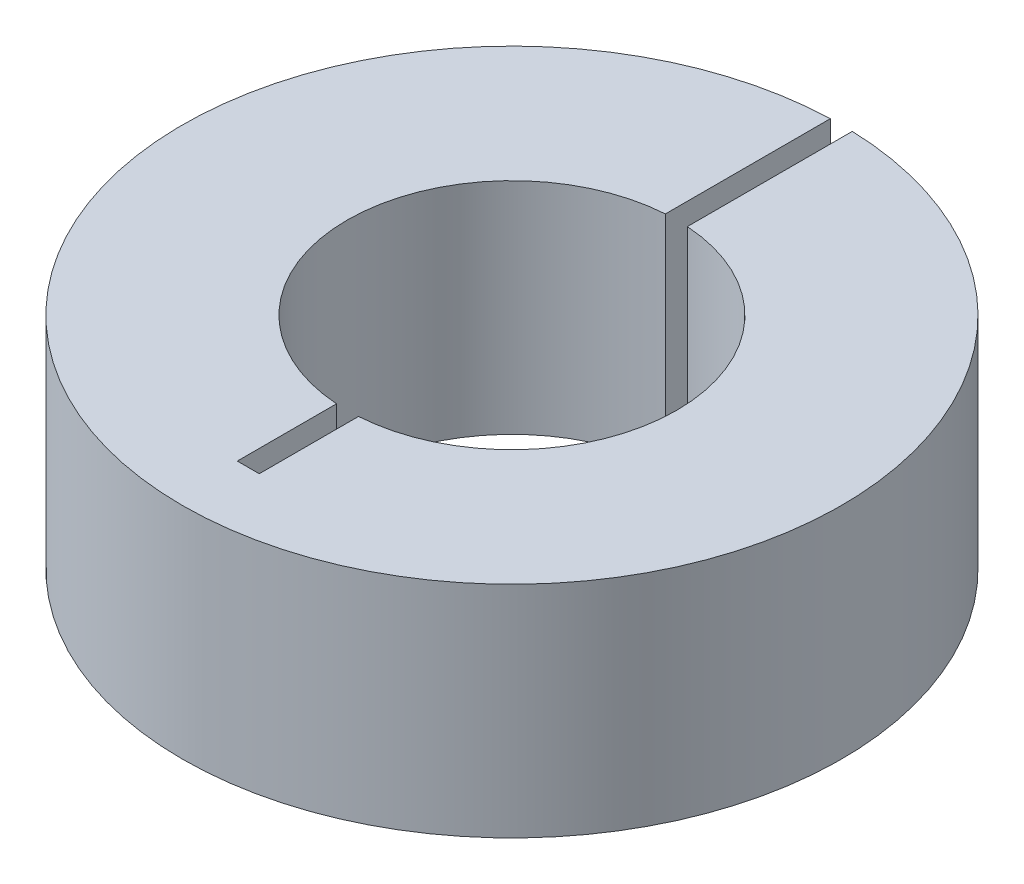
ISO-10303-21;
HEADER;
FILE_DESCRIPTION(('STEP AP214'),'2;1');
FILE_NAME('part.step','',(''),(''),'','','');
FILE_SCHEMA(('AUTOMOTIVE_DESIGN { 1 0 10303 214 1 1 1 1 }'));
ENDSEC;
DATA;
#1=APPLICATION_CONTEXT('core data for automotive mechanical design processes');
#2=APPLICATION_PROTOCOL_DEFINITION('international standard','automotive_design',2000,#1);
#3=PRODUCT_CONTEXT('',#1,'mechanical');
#4=PRODUCT('Part','Part','',(#3));
#5=PRODUCT_RELATED_PRODUCT_CATEGORY('part','',(#4));
#6=PRODUCT_DEFINITION_FORMATION('','',#4);
#7=PRODUCT_DEFINITION_CONTEXT('part definition',#1,'design');
#8=PRODUCT_DEFINITION('design','',#6,#7);
#9=PRODUCT_DEFINITION_SHAPE('','',#8);
#10=(LENGTH_UNIT() NAMED_UNIT(*) SI_UNIT(.MILLI.,.METRE.));
#11=(NAMED_UNIT(*) PLANE_ANGLE_UNIT() SI_UNIT($,.RADIAN.));
#12=(NAMED_UNIT(*) SI_UNIT($,.STERADIAN.) SOLID_ANGLE_UNIT());
#13=UNCERTAINTY_MEASURE_WITH_UNIT(LENGTH_MEASURE(1.E-05),#10,'distance_accuracy_value','');
#14=(GEOMETRIC_REPRESENTATION_CONTEXT(3) GLOBAL_UNCERTAINTY_ASSIGNED_CONTEXT((#13)) GLOBAL_UNIT_ASSIGNED_CONTEXT((#10,
#11,#12)) REPRESENTATION_CONTEXT('',''));
#15=CARTESIAN_POINT('',(0.,0.,0.));
#16=DIRECTION('',(0.,0.,1.));
#17=DIRECTION('',(1.,0.,0.));
#18=AXIS2_PLACEMENT_3D('',#15,#16,#17);
#19=CARTESIAN_POINT('',(0.,12.7,0.));
#20=DIRECTION('',(0.,-1.,0.));
#21=DIRECTION('',(0.,0.,-1.));
#22=AXIS2_PLACEMENT_3D('',#19,#20,#21);
#23=CYLINDRICAL_SURFACE('',#22,9.525);
#24=DIRECTION('',(0.,-1.,0.));
#25=VECTOR('',#24,1.);
#26=CARTESIAN_POINT('',(-0.635,12.7,-9.50380976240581));
#27=LINE('',#26,#25);
#28=CARTESIAN_POINT('',(-0.635,12.7,-9.50380976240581));
#29=VERTEX_POINT('',#28);
#30=CARTESIAN_POINT('',(-0.635,0.,-9.50380976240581));
#31=VERTEX_POINT('',#30);
#32=EDGE_CURVE('E11',#29,#31,#27,.T.);
#33=ORIENTED_EDGE('',*,*,#32,.F.);
#34=CARTESIAN_POINT('',(0.,12.7,0.));
#35=DIRECTION('',(0.,1.,0.));
#36=DIRECTION('',(0.,0.,1.));
#37=AXIS2_PLACEMENT_3D('',#34,#35,#36);
#38=CIRCLE('',#37,9.525);
#39=CARTESIAN_POINT('',(-0.635,12.7,9.50380976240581));
#40=VERTEX_POINT('',#39);
#41=EDGE_CURVE('E139',#29,#40,#38,.T.);
#42=ORIENTED_EDGE('',*,*,#41,.T.);
#43=DIRECTION('',(0.,-1.,0.));
#44=VECTOR('',#43,1.);
#45=CARTESIAN_POINT('',(-0.635,12.7,9.50380976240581));
#46=LINE('',#45,#44);
#47=CARTESIAN_POINT('',(-0.635,0.,9.50380976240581));
#48=VERTEX_POINT('',#47);
#49=EDGE_CURVE('E38',#48,#40,#46,.F.);
#50=ORIENTED_EDGE('',*,*,#49,.F.);
#51=CARTESIAN_POINT('',(0.,0.,0.));
#52=DIRECTION('',(0.,1.,0.));
#53=DIRECTION('',(0.,0.,1.));
#54=AXIS2_PLACEMENT_3D('',#51,#52,#53);
#55=CIRCLE('',#54,9.525);
#56=EDGE_CURVE('E135',#31,#48,#55,.T.);
#57=ORIENTED_EDGE('',*,*,#56,.F.);
#58=EDGE_LOOP('',(#33,#42,#50,#57));
#59=FACE_BOUND('',#58,.T.);
#60=ADVANCED_FACE('F30',(#59),#23,.F.);
#61=CARTESIAN_POINT('',(0.,12.7,0.));
#62=DIRECTION('',(0.,1.,0.));
#63=DIRECTION('',(0.,0.,1.));
#64=AXIS2_PLACEMENT_3D('',#61,#62,#63);
#65=PLANE('',#64);
#66=DIRECTION('',(0.,0.,1.));
#67=VECTOR('',#66,1.);
#68=CARTESIAN_POINT('',(-0.635,12.7,-35.56));
#69=LINE('',#68,#67);
#70=CARTESIAN_POINT('',(-0.635,12.7,-19.0394137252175));
#71=VERTEX_POINT('',#70);
#72=EDGE_CURVE('E52',#71,#29,#69,.T.);
#73=ORIENTED_EDGE('',*,*,#72,.F.);
#74=CARTESIAN_POINT('',(0.,12.7,0.));
#75=DIRECTION('',(0.,1.,0.));
#76=DIRECTION('',(0.,0.,1.));
#77=AXIS2_PLACEMENT_3D('',#74,#75,#76);
#78=CIRCLE('',#77,19.05);
#79=CARTESIAN_POINT('',(0.635,12.7,-19.0394137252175));
#80=VERTEX_POINT('',#79);
#81=EDGE_CURVE('E146',#71,#80,#78,.T.);
#82=ORIENTED_EDGE('',*,*,#81,.T.);
#83=DIRECTION('',(0.,0.,-1.));
#84=VECTOR('',#83,1.);
#85=CARTESIAN_POINT('',(0.635,12.7,-35.56));
#86=LINE('',#85,#84);
#87=CARTESIAN_POINT('',(0.635,12.7,-9.50380976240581));
#88=VERTEX_POINT('',#87);
#89=EDGE_CURVE('E118',#88,#80,#86,.T.);
#90=ORIENTED_EDGE('',*,*,#89,.F.);
#91=CARTESIAN_POINT('',(0.635,12.7,9.50380976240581));
#92=VERTEX_POINT('',#91);
#93=EDGE_CURVE('E140',#92,#88,#38,.T.);
#94=ORIENTED_EDGE('',*,*,#93,.F.);
#95=CARTESIAN_POINT('',(0.635,12.7,15.24));
#96=VERTEX_POINT('',#95);
#97=EDGE_CURVE('E117',#96,#92,#86,.T.);
#98=ORIENTED_EDGE('',*,*,#97,.F.);
#99=DIRECTION('',(1.,0.,0.));
#100=VECTOR('',#99,1.);
#101=CARTESIAN_POINT('',(-0.635,12.7,15.24));
#102=LINE('',#101,#100);
#103=CARTESIAN_POINT('',(-0.635,12.7,15.24));
#104=VERTEX_POINT('',#103);
#105=EDGE_CURVE('E107',#104,#96,#102,.T.);
#106=ORIENTED_EDGE('',*,*,#105,.F.);
#107=EDGE_CURVE('E93',#40,#104,#69,.T.);
#108=ORIENTED_EDGE('',*,*,#107,.F.);
#109=ORIENTED_EDGE('',*,*,#41,.F.);
#110=EDGE_LOOP('',(#73,#82,#90,#94,#98,#106,#108,#109));
#111=FACE_BOUND('',#110,.T.);
#112=ADVANCED_FACE('F115',(#111),#65,.T.);
#113=CARTESIAN_POINT('',(0.,0.,0.));
#114=DIRECTION('',(0.,1.,0.));
#115=DIRECTION('',(0.,0.,1.));
#116=AXIS2_PLACEMENT_3D('',#113,#114,#115);
#117=PLANE('',#116);
#118=CARTESIAN_POINT('',(0.,0.,0.));
#119=DIRECTION('',(0.,1.,0.));
#120=DIRECTION('',(0.,0.,1.));
#121=AXIS2_PLACEMENT_3D('',#118,#119,#120);
#122=CIRCLE('',#121,19.05);
#123=CARTESIAN_POINT('',(-0.635,0.,-19.0394137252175));
#124=VERTEX_POINT('',#123);
#125=CARTESIAN_POINT('',(0.635,0.,-19.0394137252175));
#126=VERTEX_POINT('',#125);
#127=EDGE_CURVE('E143',#124,#126,#122,.T.);
#128=ORIENTED_EDGE('',*,*,#127,.F.);
#129=DIRECTION('',(0.,0.,1.));
#130=VECTOR('',#129,1.);
#131=CARTESIAN_POINT('',(-0.635,0.,-35.56));
#132=LINE('',#131,#130);
#133=EDGE_CURVE('E124',#124,#31,#132,.T.);
#134=ORIENTED_EDGE('',*,*,#133,.T.);
#135=ORIENTED_EDGE('',*,*,#56,.T.);
#136=CARTESIAN_POINT('',(-0.635,0.,15.24));
#137=VERTEX_POINT('',#136);
#138=EDGE_CURVE('E122',#48,#137,#132,.T.);
#139=ORIENTED_EDGE('',*,*,#138,.T.);
#140=DIRECTION('',(1.,0.,0.));
#141=VECTOR('',#140,1.);
#142=CARTESIAN_POINT('',(-0.635,0.,15.24));
#143=LINE('',#142,#141);
#144=CARTESIAN_POINT('',(0.635,0.,15.24));
#145=VERTEX_POINT('',#144);
#146=EDGE_CURVE('E110',#137,#145,#143,.T.);
#147=ORIENTED_EDGE('',*,*,#146,.T.);
#148=DIRECTION('',(0.,0.,-1.));
#149=VECTOR('',#148,1.);
#150=CARTESIAN_POINT('',(0.635,0.,-35.56));
#151=LINE('',#150,#149);
#152=CARTESIAN_POINT('',(0.635,0.,9.50380976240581));
#153=VERTEX_POINT('',#152);
#154=EDGE_CURVE('E113',#145,#153,#151,.T.);
#155=ORIENTED_EDGE('',*,*,#154,.T.);
#156=CARTESIAN_POINT('',(0.635,0.,-9.50380976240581));
#157=VERTEX_POINT('',#156);
#158=EDGE_CURVE('E136',#153,#157,#55,.T.);
#159=ORIENTED_EDGE('',*,*,#158,.T.);
#160=EDGE_CURVE('E45',#157,#126,#151,.T.);
#161=ORIENTED_EDGE('',*,*,#160,.T.);
#162=EDGE_LOOP('',(#128,#134,#135,#139,#147,#155,#159,#161));
#163=FACE_BOUND('',#162,.T.);
#164=ADVANCED_FACE('F160',(#163),#117,.F.);
#165=CARTESIAN_POINT('',(0.,12.7,0.));
#166=DIRECTION('',(0.,-1.,0.));
#167=DIRECTION('',(0.,0.,-1.));
#168=AXIS2_PLACEMENT_3D('',#165,#166,#167);
#169=CYLINDRICAL_SURFACE('',#168,19.05);
#170=ORIENTED_EDGE('',*,*,#81,.F.);
#171=DIRECTION('',(0.,-1.,0.));
#172=VECTOR('',#171,1.);
#173=CARTESIAN_POINT('',(-0.635,12.7,-19.0394137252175));
#174=LINE('',#173,#172);
#175=EDGE_CURVE('E132',#71,#124,#174,.T.);
#176=ORIENTED_EDGE('',*,*,#175,.T.);
#177=ORIENTED_EDGE('',*,*,#127,.T.);
#178=DIRECTION('',(0.,-1.,0.));
#179=VECTOR('',#178,1.);
#180=CARTESIAN_POINT('',(0.635,12.7,-19.0394137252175));
#181=LINE('',#180,#179);
#182=EDGE_CURVE('E128',#126,#80,#181,.F.);
#183=ORIENTED_EDGE('',*,*,#182,.T.);
#184=EDGE_LOOP('',(#170,#176,#177,#183));
#185=FACE_BOUND('',#184,.T.);
#186=ADVANCED_FACE('F32',(#185),#169,.T.);
#187=DIRECTION('',(0.,-1.,0.));
#188=VECTOR('',#187,1.);
#189=CARTESIAN_POINT('',(0.635,12.7,9.50380976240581));
#190=LINE('',#189,#188);
#191=EDGE_CURVE('E151',#92,#153,#190,.T.);
#192=ORIENTED_EDGE('',*,*,#191,.F.);
#193=ORIENTED_EDGE('',*,*,#93,.T.);
#194=DIRECTION('',(0.,-1.,0.));
#195=VECTOR('',#194,1.);
#196=CARTESIAN_POINT('',(0.635,12.7,-9.50380976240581));
#197=LINE('',#196,#195);
#198=EDGE_CURVE('E149',#157,#88,#197,.F.);
#199=ORIENTED_EDGE('',*,*,#198,.F.);
#200=ORIENTED_EDGE('',*,*,#158,.F.);
#201=EDGE_LOOP('',(#192,#193,#199,#200));
#202=FACE_BOUND('',#201,.T.);
#203=ADVANCED_FACE('F161',(#202),#23,.F.);
#204=CARTESIAN_POINT('',(0.635,0.,-35.56));
#205=DIRECTION('',(1.,0.,0.));
#206=DIRECTION('',(0.,0.,-1.));
#207=AXIS2_PLACEMENT_3D('',#204,#205,#206);
#208=PLANE('',#207);
#209=ORIENTED_EDGE('',*,*,#160,.F.);
#210=ORIENTED_EDGE('',*,*,#198,.T.);
#211=ORIENTED_EDGE('',*,*,#89,.T.);
#212=ORIENTED_EDGE('',*,*,#182,.F.);
#213=EDGE_LOOP('',(#209,#210,#211,#212));
#214=FACE_BOUND('',#213,.T.);
#215=ADVANCED_FACE('F163',(#214),#208,.F.);
#216=ORIENTED_EDGE('',*,*,#191,.T.);
#217=ORIENTED_EDGE('',*,*,#154,.F.);
#218=DIRECTION('',(0.,1.,0.));
#219=VECTOR('',#218,1.);
#220=CARTESIAN_POINT('',(0.635,0.,15.24));
#221=LINE('',#220,#219);
#222=EDGE_CURVE('E112',#145,#96,#221,.T.);
#223=ORIENTED_EDGE('',*,*,#222,.T.);
#224=ORIENTED_EDGE('',*,*,#97,.T.);
#225=EDGE_LOOP('',(#216,#217,#223,#224));
#226=FACE_BOUND('',#225,.T.);
#227=ADVANCED_FACE('F155',(#226),#208,.F.);
#228=CARTESIAN_POINT('',(-0.635,0.,-35.56));
#229=DIRECTION('',(-1.,0.,0.));
#230=DIRECTION('',(0.,0.,1.));
#231=AXIS2_PLACEMENT_3D('',#228,#229,#230);
#232=PLANE('',#231);
#233=ORIENTED_EDGE('',*,*,#49,.T.);
#234=ORIENTED_EDGE('',*,*,#107,.T.);
#235=DIRECTION('',(0.,1.,0.));
#236=VECTOR('',#235,1.);
#237=CARTESIAN_POINT('',(-0.635,0.,15.24));
#238=LINE('',#237,#236);
#239=EDGE_CURVE('E96',#137,#104,#238,.T.);
#240=ORIENTED_EDGE('',*,*,#239,.F.);
#241=ORIENTED_EDGE('',*,*,#138,.F.);
#242=EDGE_LOOP('',(#233,#234,#240,#241));
#243=FACE_BOUND('',#242,.T.);
#244=ADVANCED_FACE('F95',(#243),#232,.F.);
#245=CARTESIAN_POINT('',(-0.635,0.,15.24));
#246=DIRECTION('',(0.,0.,1.));
#247=DIRECTION('',(1.,0.,0.));
#248=AXIS2_PLACEMENT_3D('',#245,#246,#247);
#249=PLANE('',#248);
#250=ORIENTED_EDGE('',*,*,#105,.T.);
#251=ORIENTED_EDGE('',*,*,#222,.F.);
#252=ORIENTED_EDGE('',*,*,#146,.F.);
#253=ORIENTED_EDGE('',*,*,#239,.T.);
#254=EDGE_LOOP('',(#250,#251,#252,#253));
#255=FACE_BOUND('',#254,.T.);
#256=ADVANCED_FACE('F106',(#255),#249,.F.);
#257=ORIENTED_EDGE('',*,*,#72,.T.);
#258=ORIENTED_EDGE('',*,*,#32,.T.);
#259=ORIENTED_EDGE('',*,*,#133,.F.);
#260=ORIENTED_EDGE('',*,*,#175,.F.);
#261=EDGE_LOOP('',(#257,#258,#259,#260));
#262=FACE_BOUND('',#261,.T.);
#263=ADVANCED_FACE('F170',(#262),#232,.F.);
#264=CLOSED_SHELL('',(#60,#112,#164,#186,#203,#215,#227,#244,#256,#263));
#265=MANIFOLD_SOLID_BREP('B2',#264);
#266=ADVANCED_BREP_SHAPE_REPRESENTATION('',(#18,#265),#14);
#267=SHAPE_DEFINITION_REPRESENTATION(#9,#266);
ENDSEC;
END-ISO-10303-21;
